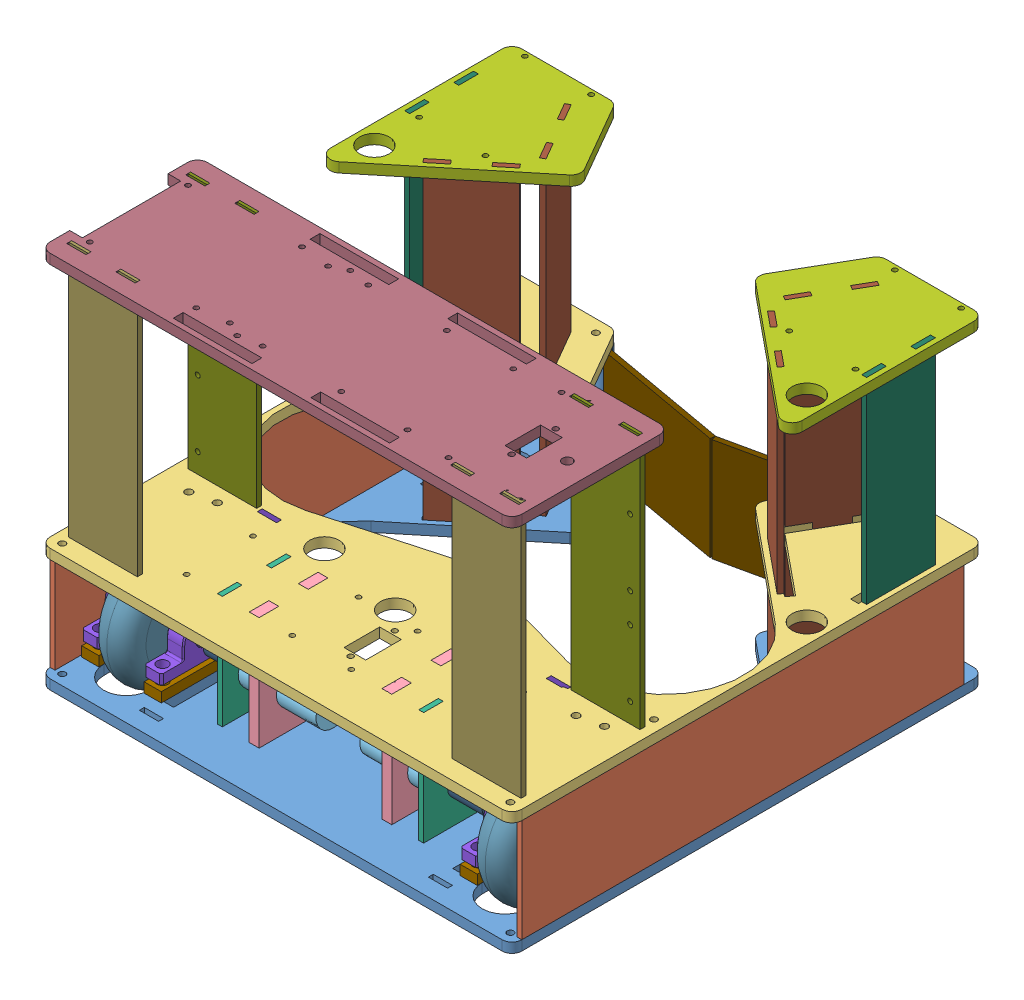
SolidWorks assembly robot.SLDASM, configuration Default (file format 3800). Lengths in mm.
Overall size (304.8 252.41 304.8).
41 component instances, 19 part files, 114 mates.
Components (placement in the parent):
- base-1: base.SLDPRT [Default] at (-219.494 -68.6626 -48.0493) size (304.8 6.35 304.8)
- side_plate-1: side_plate.SLDPRT [Default] at (-70.269 -62.3126 -54.3993) size (3.17 66.67 285.75)
- side_plate-2: side_plate.SLDPRT [Default] at (-371.894 -62.3126 -54.3993) size (3.17 66.67 285.75)
- platform1-1: platform1.SLDPRT [Default] at (-219.494 4.3624 -48.0493) size (304.8 6.35 304.8)
- motor_cradle-1: motor_cradle.SLDPRT [Default] at (-265.5315 -62.3126 -98.9489) size (6.35 79.38 44.45)
- motor_cradle-2: motor_cradle.SLDPRT [Default] at (-179.8065 -62.3126 -98.9489) size (6.35 79.38 44.45)
- motor-1: motor.SLDPRT [Default] at (-233.6315 -38.5001 -98.9489) x (-1 0 0) z (0 -0.866025 0.5) size (59.9 24 24)
- motor-2: motor.SLDPRT [Default] at (-205.3565 -38.5001 -98.9489) size (59.9 24 24)
- motor_plate-1: motor_plate.SLDPRT [Default] at (-286.1065 -62.3126 -98.9489) size (3.17 79.38 44.45)
- motor_plate-2: motor_plate.SLDPRT [Default] at (-156.0565 -62.3126 -98.9489) size (3.17 79.38 44.45)
- platform2-1: platform2.SLDPRT [Default] at (-219.494 131.3624 -48.0493) size (94.68 6.35 123.69)
- mount_bearings_2820T110-1: mount_bearings_2820T110.SLDPRT [2820T11] at (-361.8928 -38.5001 -98.9489) x (0 0 1) z (-1 0 0) size (57.15 28.57 11.11)
- mount_bearings_2820T110-2: mount_bearings_2820T110.SLDPRT [2820T11] at (-321.5703 -38.5001 -98.9489) x (0 0 1) z (-1 0 0) size (57.15 28.57 11.11)
- mount_bearings_2820T110-3: mount_bearings_2820T110.SLDPRT [2820T11] at (-117.4178 -38.5001 -98.9489) x (0 0 1) z (-1 0 0) size (57.15 28.57 11.11)
- mount_bearings_2820T110-4: mount_bearings_2820T110.SLDPRT [2820T11] at (-77.0953 -38.5001 -98.9489) x (0 0 1) z (-1 0 0) size (57.15 28.57 11.11)
- bearing_spacer-1: bearing_spacer.SLDPRT [Default] at (-361.8928 -62.3126 -70.3739) size (11.11 6.35 57.15)
- bearing_spacer-2: bearing_spacer.SLDPRT [Default] at (-321.5703 -62.3126 -70.3739) size (11.11 6.35 57.15)
- bearing_spacer-3: bearing_spacer.SLDPRT [Default] at (-117.4178 -62.3126 -70.3739) size (11.11 6.35 57.15)
- bearing_spacer-4: bearing_spacer.SLDPRT [Default] at (-77.0953 -62.3126 -70.3739) size (11.11 6.35 57.15)
- spider_coupler-1: spider_coupler.SLDPRT [Default] at (-309.5565 -38.5001 -98.9489) x (1 0 0) z (0 0.866025 -0.5) size (22.23 15.88 15.88)
- spider_coupler-2: spider_coupler.SLDPRT [Default] at (-129.4315 -38.5001 -98.9489) x (-1 0 0) z (0 0 -1) size (22.23 15.88 15.88)
- column_beam1-2: column_beam1.SLDPRT [Default] at (-318.7591 -62.3126 -273.8522) x (0.633889 0 0.773424) z (-0.773424 0 0.633889) size (3.17 206.38 44.45)
- column_beam1-3: column_beam1.SLDPRT [Default] at (-310.0261 -62.3126 -316.769) x (0.866025 0 -0.5) z (0.5 0 0.866025) size (3.17 206.38 44.45)
- column_beam1-5: column_beam1.SLDPRT [Default] at (-131.7116 -62.3126 -318.3565) x (0.866025 0 0.5) z (-0.5 0 0.866025) size (3.17 206.38 44.45)
- column_beam1-6: column_beam1.SLDPRT [Default] at (-120.229 -62.3126 -273.8522) x (-0.633889 0 0.773424) z (-0.773424 0 -0.633889) size (3.17 206.38 44.45)
- platform2-2: platform2.SLDPRT [Default] at (-219.494 137.7124 -48.0493) x (-1 0 0) z (0 0 1) size (94.68 6.35 123.69)
- column_beam2-2: column_beam2.SLDPRT [Default] at (-343.573 10.7124 -60.2413) x (0 0 -1) z (1 0 0) size (3.17 171.45 44.45)
- column_beam2-4: column_beam2.SLDPRT [Default] at (-95.669 10.7124 -63.4163) x (0 0 1) z (-1 0 0) size (3.17 171.45 44.45)
- platform3-1: platform3.SLDPRT [Default] at (-219.494 169.4624 -48.0493) size (304.8 6.35 101.6)
- wheel-1: wheel.SLDPRT [Default] at (-109.9565 -38.5001 -98.9489) x (0 0 -1) z (1 0 0) size (76.2 76.2 25.4)
- wheel-2: wheel.SLDPRT [Default] at (-354.4315 -38.5001 -98.9489) x (0 0 -1) z (1 0 0) size (76.2 76.2 25.4)
- column_beam1_holes-1: column_beam1_holes.SLDPRT [Default] at (-73.444 -62.3126 -302.5667) size (3.17 206.38 44.45)
- column_beam1_holes-2: column_beam1_holes.SLDPRT [Default] at (-368.719 -62.3126 -302.5667) size (3.17 206.38 44.45)
- column_beam2_holes-1: column_beam2_holes.SLDPRT [Default] at (-95.669 10.7124 -140.2513) x (0 0 1) z (-1 0 0) size (3.17 171.45 44.45)
- column_beam2_holes-3: column_beam2_holes.SLDPRT [Default] at (-343.319 10.7124 -137.0763) x (0 0 -1) z (1 0 0) size (3.17 171.45 44.45)
- tape_mount-1: tape_mount.SLDPRT [Default] at (-126.022 -68.6626 -135.4614) x (0 0 -1) z (1 0 0) size (3.17 79.38 25.4)
- tape_mount-2: tape_mount.SLDPRT [Default] at (-312.712 -68.6626 -135.4614) x (0 0 -1) z (1 0 0) size (3.17 79.38 25.4)
- gate-1: gate.SLDPRT [Default] at (-177.9504 -62.3126 -341.1539) x (0.977141 0 -0.212594) z (0.212594 0 0.977141) size (85.09 66.67 3.17)
- gate-2: gate.SLDPRT [Default] at (-261.4051 -62.3126 -339.5895) x (0.984422 0 0.175823) z (-0.175823 0 0.984422) size (85.09 66.67 3.17)
- standoff-1: standoff.SLDPRT [Default] at (-131.0446 -62.3126 -348.0868) size (9.53 66.67 9.53)
- standoff-2: standoff.SLDPRT [Default] at (-307.9435 -62.3126 -348.0868) size (9.53 66.67 9.53)
Mates (geometry in assembly coordinates):
- Coincident1: coincident anti-aligned: plane of base-1 through (-73.444 -62.3126 -54.3993) normal (0 1 0); plane of side_plate-2 through (-368.719 -62.3126 -54.3993) normal (0 -1 0)
- Coincident2: coincident aligned: plane of side_plate-2 through (-371.894 4.3624 -54.3993) normal (-1 0 0); plane of base-1 through (-371.894 -62.3126 -54.3993) normal (-1 0 0)
- Coincident3: coincident anti-aligned: plane of base-1 through (-73.444 -62.3126 -54.3993) normal (0 1 0); plane of side_plate-1 through (-67.094 -62.3126 -54.3993) normal (0 -1 0)
- Coincident4: coincident aligned: plane of base-1 through (-67.094 -62.3126 -54.3993) normal (1 0 0); plane of side_plate-1 through (-67.094 4.3624 -54.3993) normal (1 0 0)
- Coincident5: coincident anti-aligned: plane of side_plate-2 through (-368.719 4.3624 -54.3993) normal (0 1 0); plane of platform1-1 through (-73.444 4.3624 -54.3993) normal (0 -1 0)
- Coincident6: coincident aligned: plane of platform1-1 through (-371.894 10.7124 -54.3993) normal (-1 0 0); plane of base-1 through (-371.894 -62.3126 -54.3993) normal (-1 0 0)
- Coincident7: coincident aligned: plane of base-1 through (-365.544 -62.3126 -48.0493) normal (0 0 1); plane of platform1-1 through (-365.544 10.7124 -48.0493) normal (0 0 1)
- Coincident8: coincident anti-aligned: plane of motor-1 through (-265.5315 -38.5001 -98.9489) normal (1 0 0); plane of motor_cradle-1 through (-265.5315 -68.6626 -76.7239) normal (-1 0 0)
- Concentric2: concentric aligned: circle of motor_cradle-2; circle of motor-2
- Concentric5: concentric aligned: circle of motor-2; circle of motor_plate-2
- Coincident15: coincident anti-aligned: plane of motor-2 through (-156.0565 -38.5001 -98.9489) normal (1 0 0); plane of motor_plate-2 through (-156.0565 -68.6626 -76.7239) normal (-1 0 0)
- Coincident17: coincident anti-aligned: plane of base-1 through (-152.8815 -62.3126 -76.8509) normal (-1 0 0); plane of motor_plate-2 through (-152.8815 -68.6626 -76.7239) normal (1 0 0)
- Coincident19: coincident anti-aligned: plane of base-1 through (-73.444 -62.3126 -54.3993) normal (0 1 0); plane of motor_plate-2 through (-152.8815 -62.3126 -89.4239) normal (0 -1 0)
- Coincident21: coincident anti-aligned: plane of base-1 through (-73.444 -62.3126 -54.3993) normal (0 1 0); plane of motor_cradle-2 through (-173.4565 -62.3126 -89.4239) normal (0 -1 0)
- Coincident22: coincident anti-aligned: plane of base-1 through (-286.1065 -62.3126 -76.8509) normal (1 0 0); plane of motor_plate-1 through (-286.1065 -68.6626 -76.7239) normal (-1 0 0)
- Coincident24: coincident anti-aligned: plane of base-1 through (-73.444 -62.3126 -54.3993) normal (0 1 0); plane of motor_plate-1 through (-282.9315 -62.3126 -89.4239) normal (0 -1 0)
- Coincident25: coincident anti-aligned: plane of base-1 through (-73.444 -62.3126 -54.3993) normal (0 1 0); plane of motor_cradle-1 through (-259.1815 -62.3126 -89.4239) normal (0 -1 0)
- Coincident26: coincident aligned: plane of platform2-1 through (-365.544 137.7124 -352.8493) normal (0 0 -1); plane of base-1 through (-365.544 -62.3126 -352.8493) normal (0 0 -1)
- Coincident27: coincident aligned: plane of platform2-1 through (-371.894 137.7124 -235.5079) normal (-1 0 0); plane of base-1 through (-371.894 -62.3126 -54.3993) normal (-1 0 0)
- Distance1: distance = 120.65 mm anti-aligned: plane of platform1-1 through (-73.444 10.7124 -54.3993) normal (0 1 0); plane of platform2-1 through (-365.544 131.3624 -235.5079) normal (0 -1 0)
- Concentric7: concentric aligned: circle of base-1; circle of mount_bearings_2820T110-1
- Concentric8: concentric aligned: circle of base-1; circle of mount_bearings_2820T110-1
- Concentric9: concentric aligned: circle of mount_bearings_2820T110-2; circle of base-1
- Concentric10: concentric aligned: circle of base-1; circle of mount_bearings_2820T110-2
- Concentric11: concentric aligned: circle of mount_bearings_2820T110-1; circle of mount_bearings_2820T110-2
- Concentric12: concentric aligned: circle of mount_bearings_2820T110-3; circle of base-1
- Concentric13: concentric aligned: circle of base-1; circle of mount_bearings_2820T110-3
- Concentric14: concentric aligned: circle of base-1; circle of mount_bearings_2820T110-4
- Concentric15: concentric aligned: circle of base-1; circle of mount_bearings_2820T110-4
- Concentric16: concentric anti-aligned: circle of mount_bearings_2820T110-3; circle of mount_bearings_2820T110-4
- Concentric17: concentric aligned: circle of motor-1; circle of mount_bearings_2820T110-2
- Concentric18: concentric aligned: circle of motor-2; circle of mount_bearings_2820T110-3
- Concentric19: concentric aligned: circle of base-1; circle of bearing_spacer-1
- Concentric20: concentric aligned: circle of base-1; circle of bearing_spacer-1
- Concentric22: concentric aligned: circle of base-1; circle of bearing_spacer-2
- Concentric24: concentric aligned: circle of base-1; circle of bearing_spacer-2
- Coincident31: coincident anti-aligned: plane of base-1 through (-73.444 -62.3126 -54.3993) normal (0 1 0); plane of bearing_spacer-1 through (-367.449 -62.3126 -70.3739) normal (0 -1 0)
- Coincident32: coincident anti-aligned: plane of base-1 through (-73.444 -62.3126 -54.3993) normal (0 1 0); plane of bearing_spacer-2 through (-327.1265 -62.3126 -70.3739) normal (0 -1 0)
- Concentric25: concentric aligned: circle of base-1; circle of bearing_spacer-3
- Concentric26: concentric aligned: circle of base-1; circle of bearing_spacer-3
- Coincident33: coincident anti-aligned: plane of base-1 through (-73.444 -62.3126 -54.3993) normal (0 1 0); plane of bearing_spacer-3 through (-122.974 -62.3126 -70.3739) normal (0 -1 0)
- Concentric27: concentric aligned: circle of base-1; circle of bearing_spacer-4
- Concentric28: concentric aligned: circle of base-1; circle of bearing_spacer-4
- Coincident34: coincident anti-aligned: plane of base-1 through (-73.444 -62.3126 -54.3993) normal (0 1 0); plane of bearing_spacer-4 through (-82.6515 -62.3126 -70.3739) normal (0 -1 0)
- Concentric30: concentric anti-aligned: circle of motor-1; circle of spider_coupler-1
- Coincident37: coincident anti-aligned: plane of motor-1 through (-293.5315 -39.8796 -99.5382) normal (0 -0.5 -0.866025); plane of spider_coupler-1 through (-298.444 -38.3207 -100.4382) normal (0 0.5 0.866025)
- Coincident38: coincident anti-aligned: plane of motor-1 through (-287.3315 -38.5001 -98.9489) normal (-1 0 0); plane of spider_coupler-1 through (-287.3315 -38.5001 -98.9489) normal (1 0 0)
- Concentric31: concentric anti-aligned: circle of motor-2; circle of spider_coupler-2
- Coincident40: coincident anti-aligned: plane of motor-2 through (-145.4565 -37.3001 -98.0489) normal (0 1 0); plane of spider_coupler-2 through (-140.544 -37.3001 -99.8489) normal (0 -1 0)
- Coincident41: coincident anti-aligned: plane of motor-2 through (-151.6565 -38.5001 -98.9489) normal (1 0 0); plane of spider_coupler-2 through (-151.6565 -38.5001 -98.9489) normal (-1 0 0)
- Coincident45: coincident anti-aligned: plane of base-1 through (-321.0116 -62.3126 -335.7964) normal (0.866025 0 -0.5); plane of column_beam1-3 through (-305.2636 -68.6626 -308.5201) normal (-0.866025 0 0.5)
- Coincident46: coincident anti-aligned: plane of base-1 through (-314.7886 -62.3126 -325.0179) normal (-0.5 0 -0.866025); plane of column_beam1-3 through (-312.039 -62.3126 -326.6054) normal (0.5 0 0.866025)
- Coincident47: coincident anti-aligned: plane of base-1 through (-73.444 -62.3126 -54.3993) normal (0 1 0); plane of column_beam1-3 through (-302.514 -62.3126 -310.1076) normal (0 -1 0)
- Coincident48: coincident anti-aligned: plane of base-1 through (-299.7536 -62.3126 -285.3238) normal (-0.633889 0 -0.773424); plane of column_beam1-2 through (-324.1134 -68.6626 -265.3588) normal (0.633889 0 0.773424)
- Coincident49: coincident anti-aligned: plane of base-1 through (-311.3922 -62.3126 -279.89) normal (0.773424 0 -0.633889); plane of column_beam1-2 through (-309.3796 -62.3126 -277.4344) normal (-0.773424 0 0.633889)
- Coincident50: coincident anti-aligned: plane of base-1 through (-73.444 -62.3126 -54.3993) normal (0 1 0); plane of column_beam1-2 through (-324.1134 -62.3126 -265.3588) normal (0 -1 0)
- Coincident54: coincident anti-aligned: plane of base-1 through (-117.9765 -62.3126 -335.7964) normal (-0.866025 0 -0.5); plane of column_beam1-5 through (-133.7245 -68.6626 -308.5201) normal (0.866025 0 0.5)
- Coincident55: coincident anti-aligned: plane of base-1 through (-124.1995 -62.3126 -325.0179) normal (0.5 0 -0.866025); plane of column_beam1-5 through (-124.1995 -62.3126 -325.0179) normal (-0.5 0 0.866025)
- Coincident56: coincident anti-aligned: plane of base-1 through (-73.444 -62.3126 -54.3993) normal (0 1 0); plane of column_beam1-5 through (-133.7245 -62.3126 -308.5201) normal (0 -1 0)
- Coincident57: coincident anti-aligned: plane of column_beam1-6 through (-127.5959 -68.6626 -279.89) normal (0.633889 0 -0.773424); plane of base-1 through (-137.2219 -62.3126 -287.7794) normal (-0.633889 0 0.773424)
- Coincident58: coincident anti-aligned: plane of base-1 through (-127.5959 -62.3126 -279.89) normal (-0.773424 0 -0.633889); plane of column_beam1-6 through (-129.6085 -62.3126 -277.4344) normal (0.773424 0 0.633889)
- Coincident59: coincident anti-aligned: plane of base-1 through (-73.444 -62.3126 -54.3993) normal (0 1 0); plane of column_beam1-6 through (-129.6085 -62.3126 -277.4344) normal (0 -1 0)
- Distance3: distance = 120.65 mm anti-aligned: plane of platform1-1 through (-73.444 10.7124 -54.3993) normal (0 1 0); plane of platform2-2 through (-73.444 131.3624 -235.5079) normal (0 -1 0)
- Coincident67: coincident anti-aligned: plane of platform1-1 through (-365.544 10.7124 -63.4163) normal (0 0 1); plane of column_beam2-2 through (-334.048 4.3624 -63.4163) normal (0 0 -1)
- Coincident68: coincident anti-aligned: plane of platform1-1 through (-353.098 10.7124 -63.4163) normal (-1 0 0); plane of column_beam2-2 through (-353.098 10.7124 -63.4163) normal (1 0 0)
- Coincident69: coincident anti-aligned: plane of platform1-1 through (-73.444 10.7124 -54.3993) normal (0 1 0); plane of column_beam2-2 through (-334.048 10.7124 -63.4163) normal (0 -1 0)
- Coincident73: coincident anti-aligned: plane of platform1-1 through (-117.64 10.7124 -63.4163) normal (0 0 1); plane of column_beam2-4 through (-105.194 4.3624 -63.4163) normal (0 0 -1)
- Coincident74: coincident anti-aligned: plane of platform1-1 through (-105.194 10.7124 -63.4163) normal (-1 0 0); plane of column_beam2-4 through (-105.194 10.7124 -60.2413) normal (1 0 0)
- Coincident75: coincident anti-aligned: plane of platform1-1 through (-73.444 10.7124 -54.3993) normal (0 1 0); plane of column_beam2-4 through (-105.194 10.7124 -60.2413) normal (0 -1 0)
- Coincident76: coincident aligned: plane of base-1 through (-365.544 -62.3126 -48.0493) normal (0 0 1); plane of platform3-1 through (-365.544 175.8124 -48.0493) normal (0 0 1)
- Coincident77: coincident aligned: plane of base-1 through (-371.894 -62.3126 -54.3993) normal (-1 0 0); plane of platform3-1 through (-371.894 175.8124 -54.3993) normal (-1 0 0)
- Distance4: distance = 158.75 mm anti-aligned: plane of platform1-1 through (-73.444 10.7124 -54.3993) normal (0 1 0); plane of platform3-1 through (-73.444 169.4624 -54.3993) normal (0 -1 0)
- Concentric32: concentric aligned: circle of wheel-1; circle of mount_bearings_2820T110-4
- Distance6: distance = 1.905 mm anti-aligned: plane of wheel-1 through (-84.5565 -38.5001 -98.9489) normal (1 0 0); plane of mount_bearings_2820T110-4 through (-82.6515 -38.5001 -98.9489) normal (-1 0 0)
- Concentric33: concentric aligned: circle of wheel-2; circle of mount_bearings_2820T110-2
- Distance7: distance = 1.905 mm anti-aligned: plane of wheel-2 through (-354.4315 -38.5001 -98.9489) normal (-1 0 0); plane of mount_bearings_2820T110-1 through (-356.3365 -38.5001 -98.9489) normal (1 0 0)
- Coincident78: coincident anti-aligned: plane of motor_cradle-2 through (-173.4565 -68.6626 -76.7239) normal (1 0 0); plane of motor-2 through (-173.4565 -38.5001 -98.9489) normal (-1 0 0)
- Coincident79: coincident anti-aligned: plane of base-1 through (-73.444 -62.3126 -324.7917) normal (1 0 0); plane of column_beam1_holes-1 through (-73.444 -68.6626 -293.0417) normal (-1 0 0)
- Coincident80: coincident anti-aligned: plane of base-1 through (-70.269 -62.3126 -324.7917) normal (0 0 1); plane of column_beam1_holes-1 through (-70.269 -68.6626 -324.7917) normal (0 0 -1)
- Coincident81: coincident anti-aligned: plane of base-1 through (-73.444 -62.3126 -54.3993) normal (0 1 0); plane of column_beam1_holes-1 through (-70.269 -62.3126 -293.0417) normal (0 -1 0)
- Coincident82: coincident anti-aligned: plane of base-1 through (-368.719 -62.3126 -324.7917) normal (0 0 1); plane of column_beam1_holes-2 through (-365.544 -68.6626 -324.7917) normal (0 0 -1)
- Coincident83: coincident anti-aligned: plane of base-1 through (-365.544 -62.3126 -324.7917) normal (-1 0 0); plane of column_beam1_holes-2 through (-365.544 -68.6626 -293.0417) normal (1 0 0)
- Coincident84: coincident anti-aligned: plane of base-1 through (-73.444 -62.3126 -54.3993) normal (0 1 0); plane of column_beam1_holes-2 through (-365.544 -62.3126 -293.0417) normal (0 -1 0)
- Coincident85: coincident aligned: plane of base-1 through (-67.094 -62.3126 -54.3993) normal (1 0 0); plane of platform2-2 through (-67.094 131.3624 -235.5079) normal (1 0 0)
- Coincident86: coincident aligned: plane of base-1 through (-73.444 -62.3126 -352.8493) normal (0 0 -1); plane of platform2-2 through (-73.444 131.3624 -352.8493) normal (0 0 -1)
- Coincident87: coincident anti-aligned: plane of platform1-1 through (-73.444 10.7124 -137.0763) normal (0 0 -1); plane of column_beam2_holes-1 through (-105.194 4.3624 -137.0763) normal (0 0 1)
- Coincident88: coincident anti-aligned: plane of platform1-1 through (-73.444 10.7124 -137.0763) normal (-1 0 0); plane of column_beam2_holes-1 through (-73.444 4.3624 -137.0763) normal (1 0 0)
- Coincident89: coincident anti-aligned: plane of platform1-1 through (-73.444 10.7124 -54.3993) normal (0 1 0); plane of column_beam2_holes-1 through (-105.194 10.7124 -137.0763) normal (0 -1 0)
- Coincident90: coincident anti-aligned: plane of platform1-1 through (-365.544 10.7124 -137.0763) normal (0 0 -1); plane of column_beam2_holes-3 through (-333.794 4.3624 -137.0763) normal (0 0 1)
- Coincident91: coincident anti-aligned: plane of platform1-1 through (-365.544 10.7124 -137.0763) normal (1 0 0); plane of column_beam2_holes-3 through (-365.544 4.3624 -140.2513) normal (-1 0 0)
- Coincident92: coincident anti-aligned: plane of platform1-1 through (-73.444 10.7124 -54.3993) normal (0 1 0); plane of column_beam2_holes-3 through (-333.794 10.7124 -140.2513) normal (0 -1 0)
- Coincident93: coincident anti-aligned: plane of base-1 through (-119.926 -62.3126 -135.4614) normal (0 0 -1); plane of tape_mount-1 through (-113.322 -62.3126 -135.4614) normal (0 0 1)
- Coincident95: coincident anti-aligned: plane of base-1 through (-132.372 -62.3126 -138.6364) normal (1 0 0); plane of tape_mount-1 through (-132.372 -68.6626 -138.6364) normal (-1 0 0)
- Coincident96: coincident anti-aligned: plane of base-1 through (-73.444 -62.3126 -54.3993) normal (0 1 0); plane of tape_mount-1 through (-132.372 -62.3126 -138.6364) normal (0 -1 0)
- Coincident97: coincident anti-aligned: plane of base-1 through (-319.062 -62.3126 -138.6364) normal (1 0 0); plane of tape_mount-2 through (-319.062 -68.6626 -138.6364) normal (-1 0 0)
- Coincident98: coincident anti-aligned: plane of base-1 through (-319.062 -62.3126 -138.6364) normal (0 0 1); plane of tape_mount-2 through (-300.012 -62.3126 -138.6364) normal (0 0 -1)
- Coincident99: coincident anti-aligned: plane of base-1 through (-73.444 -62.3126 -54.3993) normal (0 1 0); plane of tape_mount-2 through (-306.362 -62.3126 -138.6364) normal (0 -1 0)
- Coincident100: coincident aligned: line of base-1; line of side_plate-2
- Coincident101: coincident aligned: line of base-1; line of side_plate-1
- Coincident106: coincident anti-aligned: plane of motor-1 through (-282.9315 -38.5001 -98.9489) normal (-1 0 0); plane of motor_plate-1 through (-282.9315 -68.6626 -76.7239) normal (1 0 0)
- Concentric38: concentric anti-aligned: circle of motor_cradle-1; circle of motor-1
- Coincident107: coincident anti-aligned: plane of base-1 through (-73.444 -62.3126 -54.3993) normal (0 1 0); plane of standoff-1 through (-131.0446 -62.3126 -348.0868) normal (0 -1 0)
- Coincident108: coincident anti-aligned: plane of standoff-2 through (-307.9435 -62.3126 -348.0868) normal (0 -1 0); plane of base-1 through (-73.444 -62.3126 -54.3993) normal (0 1 0)
- Concentric39: concentric aligned: circle of base-1; circle of standoff-1
- Concentric40: concentric aligned: circle of base-1; circle of standoff-2
- Tangent1: tangent anti-aligned: plane of gate-1 through (-135.703 4.3624 -347.0963) normal (0.977141 0 -0.212594); cylinder of standoff-1
- Coincident109: coincident anti-aligned: plane of base-1 through (-73.444 -62.3126 -54.3993) normal (0 1 0); plane of gate-2 through (-303.8455 -62.3126 -343.9444) normal (0 -1 0)
- Coincident110: coincident anti-aligned: unknown of base-1; unknown of gate-1
- Tangent6: tangent anti-aligned: unknown of gate-2; unknown of standoff-2
- Coincident111: coincident anti-aligned: line of gate-1; line of gate-2
- Angle3: planar angle = 0.390971 rad aligned: plane of gate-1 through (-219.5229 -62.3126 -332.1091) normal (-0.212594 0 -0.977141); plane of gate-2 through (-303.2873 -62.3126 -347.0699) normal (0.175823 0 -0.984422)
- Concentric41: concentric anti-aligned: circle of motor-1; circle of motor_plate-1
- Concentric42: concentric anti-aligned: circle of motor-1; circle of motor_plate-1
- Concentric43: concentric aligned: circle of motor-2; circle of motor_plate-2
